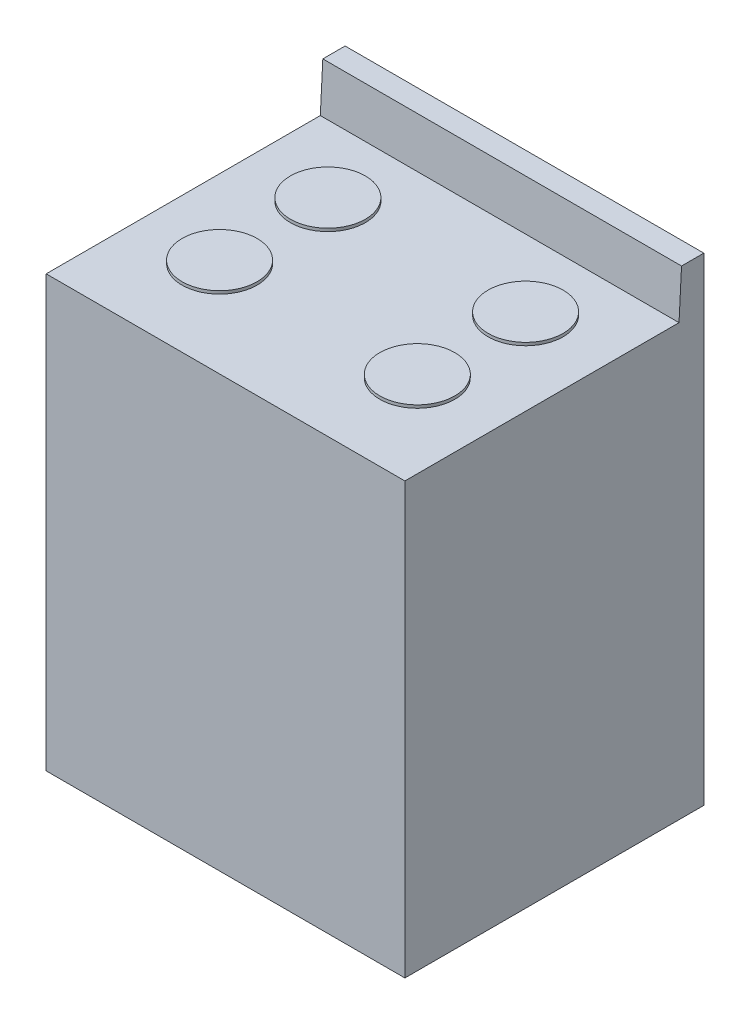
ISO-10303-21;
HEADER;
FILE_DESCRIPTION(('STEP AP214'),'2;1');
FILE_NAME('part.step','',(''),(''),'','','');
FILE_SCHEMA(('AUTOMOTIVE_DESIGN { 1 0 10303 214 1 1 1 1 }'));
ENDSEC;
DATA;
#1=APPLICATION_CONTEXT('core data for automotive mechanical design processes');
#2=APPLICATION_PROTOCOL_DEFINITION('international standard','automotive_design',2000,#1);
#3=PRODUCT_CONTEXT('',#1,'mechanical');
#4=PRODUCT('Part','Part','',(#3));
#5=PRODUCT_RELATED_PRODUCT_CATEGORY('part','',(#4));
#6=PRODUCT_DEFINITION_FORMATION('','',#4);
#7=PRODUCT_DEFINITION_CONTEXT('part definition',#1,'design');
#8=PRODUCT_DEFINITION('design','',#6,#7);
#9=PRODUCT_DEFINITION_SHAPE('','',#8);
#10=(LENGTH_UNIT() NAMED_UNIT(*) SI_UNIT(.MILLI.,.METRE.));
#11=(NAMED_UNIT(*) PLANE_ANGLE_UNIT() SI_UNIT($,.RADIAN.));
#12=(NAMED_UNIT(*) SI_UNIT($,.STERADIAN.) SOLID_ANGLE_UNIT());
#13=UNCERTAINTY_MEASURE_WITH_UNIT(LENGTH_MEASURE(1.E-05),#10,'distance_accuracy_value','');
#14=(GEOMETRIC_REPRESENTATION_CONTEXT(3) GLOBAL_UNCERTAINTY_ASSIGNED_CONTEXT((#13)) GLOBAL_UNIT_ASSIGNED_CONTEXT((#10,
#11,#12)) REPRESENTATION_CONTEXT('',''));
#15=CARTESIAN_POINT('',(0.,0.,0.));
#16=DIRECTION('',(0.,0.,1.));
#17=DIRECTION('',(1.,0.,0.));
#18=AXIS2_PLACEMENT_3D('',#15,#16,#17);
#19=CARTESIAN_POINT('',(-37.6058885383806,26.8823343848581,635.));
#20=DIRECTION('',(0.,-1.,0.));
#21=DIRECTION('',(0.,0.,-1.));
#22=AXIS2_PLACEMENT_3D('',#19,#20,#21);
#23=PLANE('',#22);
#24=CARTESIAN_POINT('',(127.659294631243,26.8823343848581,201.890902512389));
#25=DIRECTION('',(0.,-1.,0.));
#26=DIRECTION('',(0.,0.,-1.));
#27=AXIS2_PLACEMENT_3D('',#24,#25,#26);
#28=CIRCLE('',#27,79.6749402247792);
#29=CARTESIAN_POINT('',(127.659294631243,26.8823343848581,122.21596228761));
#30=VERTEX_POINT('',#29);
#31=EDGE_CURVE('E118',#30,#30,#28,.F.);
#32=ORIENTED_EDGE('',*,*,#31,.F.);
#33=EDGE_LOOP('',(#32));
#34=FACE_BOUND('',#33,.T.);
#35=DIRECTION('',(-1.,0.,0.));
#36=VECTOR('',#35,1.);
#37=CARTESIAN_POINT('',(-37.6058885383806,26.8823343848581,52.6913327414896));
#38=LINE('',#37,#36);
#39=CARTESIAN_POINT('',(-37.6058885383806,26.8823343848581,52.6913327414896));
#40=VERTEX_POINT('',#39);
#41=CARTESIAN_POINT('',(724.394111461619,26.8823343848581,52.6913327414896));
#42=VERTEX_POINT('',#41);
#43=EDGE_CURVE('E53',#40,#42,#38,.F.);
#44=ORIENTED_EDGE('',*,*,#43,.F.);
#45=DIRECTION('',(0.,0.,-1.));
#46=VECTOR('',#45,1.);
#47=CARTESIAN_POINT('',(-37.6058885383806,26.8823343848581,635.));
#48=LINE('',#47,#46);
#49=CARTESIAN_POINT('',(-37.6058885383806,26.8823343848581,635.));
#50=VERTEX_POINT('',#49);
#51=EDGE_CURVE('E98',#50,#40,#48,.T.);
#52=ORIENTED_EDGE('',*,*,#51,.F.);
#53=DIRECTION('',(-1.,0.,0.));
#54=VECTOR('',#53,1.);
#55=CARTESIAN_POINT('',(-37.6058885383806,26.8823343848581,635.));
#56=LINE('',#55,#54);
#57=CARTESIAN_POINT('',(724.394111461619,26.8823343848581,635.));
#58=VERTEX_POINT('',#57);
#59=EDGE_CURVE('E93',#58,#50,#56,.T.);
#60=ORIENTED_EDGE('',*,*,#59,.F.);
#61=DIRECTION('',(0.,0.,-1.));
#62=VECTOR('',#61,1.);
#63=CARTESIAN_POINT('',(724.394111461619,26.8823343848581,635.));
#64=LINE('',#63,#62);
#65=EDGE_CURVE('E91',#58,#42,#64,.T.);
#66=ORIENTED_EDGE('',*,*,#65,.T.);
#67=EDGE_LOOP('',(#44,#52,#60,#66));
#68=FACE_BOUND('',#67,.T.);
#69=CARTESIAN_POINT('',(547.659294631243,26.8823343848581,201.890902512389));
#70=DIRECTION('',(0.,-1.,0.));
#71=DIRECTION('',(0.,0.,-1.));
#72=AXIS2_PLACEMENT_3D('',#69,#70,#71);
#73=CIRCLE('',#72,79.6749402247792);
#74=CARTESIAN_POINT('',(547.659294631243,26.8823343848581,122.21596228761));
#75=VERTEX_POINT('',#74);
#76=EDGE_CURVE('E121',#75,#75,#73,.F.);
#77=ORIENTED_EDGE('',*,*,#76,.F.);
#78=EDGE_LOOP('',(#77));
#79=FACE_BOUND('',#78,.T.);
#80=CARTESIAN_POINT('',(127.659294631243,26.8823343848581,431.890902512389));
#81=DIRECTION('',(0.,-1.,0.));
#82=DIRECTION('',(0.,0.,-1.));
#83=AXIS2_PLACEMENT_3D('',#80,#81,#82);
#84=CIRCLE('',#83,79.6749402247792);
#85=CARTESIAN_POINT('',(127.659294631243,26.8823343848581,352.21596228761));
#86=VERTEX_POINT('',#85);
#87=EDGE_CURVE('E125',#86,#86,#84,.F.);
#88=ORIENTED_EDGE('',*,*,#87,.F.);
#89=EDGE_LOOP('',(#88));
#90=FACE_BOUND('',#89,.T.);
#91=CARTESIAN_POINT('',(547.659294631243,26.8823343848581,431.890902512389));
#92=DIRECTION('',(0.,-1.,0.));
#93=DIRECTION('',(0.,0.,-1.));
#94=AXIS2_PLACEMENT_3D('',#91,#92,#93);
#95=CIRCLE('',#94,79.6749402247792);
#96=CARTESIAN_POINT('',(547.659294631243,26.8823343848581,352.21596228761));
#97=VERTEX_POINT('',#96);
#98=EDGE_CURVE('E46',#97,#97,#95,.F.);
#99=ORIENTED_EDGE('',*,*,#98,.F.);
#100=EDGE_LOOP('',(#99));
#101=FACE_BOUND('',#100,.T.);
#102=ADVANCED_FACE('F37',(#34,#68,#79,#90,#101),#23,.F.);
#103=CARTESIAN_POINT('',(-37.6058885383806,26.8823343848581,635.));
#104=DIRECTION('',(1.,0.,0.));
#105=DIRECTION('',(0.,1.,0.));
#106=AXIS2_PLACEMENT_3D('',#103,#104,#105);
#107=PLANE('',#106);
#108=DIRECTION('',(0.,-1.,0.));
#109=VECTOR('',#108,1.);
#110=CARTESIAN_POINT('',(-37.6058885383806,26.8823343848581,0.));
#111=LINE('',#110,#109);
#112=CARTESIAN_POINT('',(-37.6058885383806,128.482334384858,0.));
#113=VERTEX_POINT('',#112);
#114=CARTESIAN_POINT('',(-37.6058885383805,-887.517665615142,0.));
#115=VERTEX_POINT('',#114);
#116=EDGE_CURVE('E113',#113,#115,#111,.T.);
#117=ORIENTED_EDGE('',*,*,#116,.T.);
#118=DIRECTION('',(0.,0.,-1.));
#119=VECTOR('',#118,1.);
#120=CARTESIAN_POINT('',(-37.6058885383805,-887.517665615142,635.));
#121=LINE('',#120,#119);
#122=CARTESIAN_POINT('',(-37.6058885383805,-887.517665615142,635.));
#123=VERTEX_POINT('',#122);
#124=EDGE_CURVE('E122',#123,#115,#121,.T.);
#125=ORIENTED_EDGE('',*,*,#124,.F.);
#126=DIRECTION('',(0.,-1.,0.));
#127=VECTOR('',#126,1.);
#128=CARTESIAN_POINT('',(-37.6058885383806,26.8823343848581,635.));
#129=LINE('',#128,#127);
#130=EDGE_CURVE('E313',#50,#123,#129,.T.);
#131=ORIENTED_EDGE('',*,*,#130,.F.);
#132=ORIENTED_EDGE('',*,*,#51,.T.);
#133=DIRECTION('',(0.,0.998629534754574,-0.052335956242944));
#134=VECTOR('',#133,1.);
#135=CARTESIAN_POINT('',(-37.6058885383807,128.482334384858,47.3667023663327));
#136=LINE('',#135,#134);
#137=CARTESIAN_POINT('',(-37.6058885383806,128.482334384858,47.3667023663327));
#138=VERTEX_POINT('',#137);
#139=EDGE_CURVE('E104',#138,#40,#136,.F.);
#140=ORIENTED_EDGE('',*,*,#139,.F.);
#141=DIRECTION('',(0.,0.,1.));
#142=VECTOR('',#141,1.);
#143=CARTESIAN_POINT('',(-37.6058885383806,128.482334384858,0.));
#144=LINE('',#143,#142);
#145=EDGE_CURVE('E105',#113,#138,#144,.T.);
#146=ORIENTED_EDGE('',*,*,#145,.F.);
#147=EDGE_LOOP('',(#117,#125,#131,#132,#140,#146));
#148=FACE_BOUND('',#147,.T.);
#149=ADVANCED_FACE('F136',(#148),#107,.F.);
#150=CARTESIAN_POINT('',(-37.6058885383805,-887.517665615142,635.));
#151=DIRECTION('',(0.,1.,0.));
#152=DIRECTION('',(0.,0.,1.));
#153=AXIS2_PLACEMENT_3D('',#150,#151,#152);
#154=PLANE('',#153);
#155=DIRECTION('',(1.,0.,0.));
#156=VECTOR('',#155,1.);
#157=CARTESIAN_POINT('',(-37.6058885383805,-887.517665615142,0.));
#158=LINE('',#157,#156);
#159=CARTESIAN_POINT('',(724.394111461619,-887.517665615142,0.));
#160=VERTEX_POINT('',#159);
#161=EDGE_CURVE('E328',#115,#160,#158,.T.);
#162=ORIENTED_EDGE('',*,*,#161,.T.);
#163=DIRECTION('',(0.,0.,-1.));
#164=VECTOR('',#163,1.);
#165=CARTESIAN_POINT('',(724.394111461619,-887.517665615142,635.));
#166=LINE('',#165,#164);
#167=CARTESIAN_POINT('',(724.394111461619,-887.517665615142,635.));
#168=VERTEX_POINT('',#167);
#169=EDGE_CURVE('E97',#168,#160,#166,.T.);
#170=ORIENTED_EDGE('',*,*,#169,.F.);
#171=DIRECTION('',(1.,0.,0.));
#172=VECTOR('',#171,1.);
#173=CARTESIAN_POINT('',(-37.6058885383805,-887.517665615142,635.));
#174=LINE('',#173,#172);
#175=EDGE_CURVE('E315',#123,#168,#174,.T.);
#176=ORIENTED_EDGE('',*,*,#175,.F.);
#177=ORIENTED_EDGE('',*,*,#124,.T.);
#178=EDGE_LOOP('',(#162,#170,#176,#177));
#179=FACE_BOUND('',#178,.T.);
#180=ADVANCED_FACE('F142',(#179),#154,.F.);
#181=CARTESIAN_POINT('',(724.394111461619,26.8823343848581,635.));
#182=DIRECTION('',(-1.,0.,0.));
#183=DIRECTION('',(0.,-1.,0.));
#184=AXIS2_PLACEMENT_3D('',#181,#182,#183);
#185=PLANE('',#184);
#186=DIRECTION('',(0.,1.,0.));
#187=VECTOR('',#186,1.);
#188=CARTESIAN_POINT('',(724.394111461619,26.8823343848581,0.));
#189=LINE('',#188,#187);
#190=CARTESIAN_POINT('',(724.394111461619,128.482334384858,0.));
#191=VERTEX_POINT('',#190);
#192=EDGE_CURVE('E317',#160,#191,#189,.T.);
#193=ORIENTED_EDGE('',*,*,#192,.T.);
#194=DIRECTION('',(0.,0.,-1.));
#195=VECTOR('',#194,1.);
#196=CARTESIAN_POINT('',(724.394111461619,128.482334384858,0.));
#197=LINE('',#196,#195);
#198=CARTESIAN_POINT('',(724.394111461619,128.482334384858,47.3667023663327));
#199=VERTEX_POINT('',#198);
#200=EDGE_CURVE('E110',#199,#191,#197,.T.);
#201=ORIENTED_EDGE('',*,*,#200,.F.);
#202=DIRECTION('',(0.,0.998629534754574,-0.052335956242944));
#203=VECTOR('',#202,1.);
#204=CARTESIAN_POINT('',(724.394111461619,-3.55158068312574,54.2863066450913));
#205=LINE('',#204,#203);
#206=EDGE_CURVE('E101',#199,#42,#205,.F.);
#207=ORIENTED_EDGE('',*,*,#206,.T.);
#208=ORIENTED_EDGE('',*,*,#65,.F.);
#209=DIRECTION('',(0.,1.,0.));
#210=VECTOR('',#209,1.);
#211=CARTESIAN_POINT('',(724.394111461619,26.8823343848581,635.));
#212=LINE('',#211,#210);
#213=EDGE_CURVE('E332',#168,#58,#212,.T.);
#214=ORIENTED_EDGE('',*,*,#213,.F.);
#215=ORIENTED_EDGE('',*,*,#169,.T.);
#216=EDGE_LOOP('',(#193,#201,#207,#208,#214,#215));
#217=FACE_BOUND('',#216,.T.);
#218=ADVANCED_FACE('F108',(#217),#185,.F.);
#219=CARTESIAN_POINT('',(-37.6058885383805,-887.517665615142,635.));
#220=DIRECTION('',(0.,0.,1.));
#221=DIRECTION('',(1.,0.,0.));
#222=AXIS2_PLACEMENT_3D('',#219,#220,#221);
#223=PLANE('',#222);
#224=ORIENTED_EDGE('',*,*,#130,.T.);
#225=ORIENTED_EDGE('',*,*,#175,.T.);
#226=ORIENTED_EDGE('',*,*,#213,.T.);
#227=ORIENTED_EDGE('',*,*,#59,.T.);
#228=EDGE_LOOP('',(#224,#225,#226,#227));
#229=FACE_BOUND('',#228,.T.);
#230=ADVANCED_FACE('F152',(#229),#223,.T.);
#231=CARTESIAN_POINT('',(-37.6058885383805,-887.517665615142,0.));
#232=DIRECTION('',(0.,0.,1.));
#233=DIRECTION('',(1.,0.,0.));
#234=AXIS2_PLACEMENT_3D('',#231,#232,#233);
#235=PLANE('',#234);
#236=ORIENTED_EDGE('',*,*,#116,.F.);
#237=DIRECTION('',(-1.,0.,0.));
#238=VECTOR('',#237,1.);
#239=CARTESIAN_POINT('',(-37.6058885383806,128.482334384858,0.));
#240=LINE('',#239,#238);
#241=EDGE_CURVE('E111',#191,#113,#240,.T.);
#242=ORIENTED_EDGE('',*,*,#241,.F.);
#243=ORIENTED_EDGE('',*,*,#192,.F.);
#244=ORIENTED_EDGE('',*,*,#161,.F.);
#245=EDGE_LOOP('',(#236,#242,#243,#244));
#246=FACE_BOUND('',#245,.T.);
#247=ADVANCED_FACE('F148',(#246),#235,.F.);
#248=CARTESIAN_POINT('',(-37.6058885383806,128.482334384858,47.3667023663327));
#249=DIRECTION('',(0.,0.0523359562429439,0.998629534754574));
#250=DIRECTION('',(0.,-0.998629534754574,0.052335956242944));
#251=AXIS2_PLACEMENT_3D('',#248,#249,#250);
#252=PLANE('',#251);
#253=ORIENTED_EDGE('',*,*,#43,.T.);
#254=ORIENTED_EDGE('',*,*,#206,.F.);
#255=DIRECTION('',(1.,0.,0.));
#256=VECTOR('',#255,1.);
#257=CARTESIAN_POINT('',(-37.6058885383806,128.482334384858,47.3667023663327));
#258=LINE('',#257,#256);
#259=EDGE_CURVE('E87',#138,#199,#258,.T.);
#260=ORIENTED_EDGE('',*,*,#259,.F.);
#261=ORIENTED_EDGE('',*,*,#139,.T.);
#262=EDGE_LOOP('',(#253,#254,#260,#261));
#263=FACE_BOUND('',#262,.T.);
#264=ADVANCED_FACE('F100',(#263),#252,.T.);
#265=CARTESIAN_POINT('',(-37.6058885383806,128.482334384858,47.3667023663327));
#266=DIRECTION('',(0.,1.,0.));
#267=DIRECTION('',(0.,0.,1.));
#268=AXIS2_PLACEMENT_3D('',#265,#266,#267);
#269=PLANE('',#268);
#270=ORIENTED_EDGE('',*,*,#145,.T.);
#271=ORIENTED_EDGE('',*,*,#259,.T.);
#272=ORIENTED_EDGE('',*,*,#200,.T.);
#273=ORIENTED_EDGE('',*,*,#241,.T.);
#274=EDGE_LOOP('',(#270,#271,#272,#273));
#275=FACE_BOUND('',#274,.T.);
#276=ADVANCED_FACE('F158',(#275),#269,.T.);
#277=CARTESIAN_POINT('',(127.659294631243,33.2323343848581,201.890902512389));
#278=DIRECTION('',(0.,-1.,0.));
#279=DIRECTION('',(0.,0.,-1.));
#280=AXIS2_PLACEMENT_3D('',#277,#278,#279);
#281=CYLINDRICAL_SURFACE('',#280,79.6749402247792);
#282=CARTESIAN_POINT('',(127.659294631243,33.2323343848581,201.890902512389));
#283=DIRECTION('',(0.,1.,0.));
#284=DIRECTION('',(0.,0.,1.));
#285=AXIS2_PLACEMENT_3D('',#282,#283,#284);
#286=CIRCLE('',#285,79.6749402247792);
#287=CARTESIAN_POINT('',(127.659294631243,33.2323343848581,281.565842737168));
#288=VERTEX_POINT('',#287);
#289=EDGE_CURVE('E106',#288,#288,#286,.T.);
#290=ORIENTED_EDGE('',*,*,#289,.F.);
#291=EDGE_LOOP('',(#290));
#292=FACE_BOUND('',#291,.T.);
#293=ORIENTED_EDGE('',*,*,#31,.T.);
#294=EDGE_LOOP('',(#293));
#295=FACE_BOUND('',#294,.T.);
#296=ADVANCED_FACE('F206',(#292,#295),#281,.T.);
#297=CARTESIAN_POINT('',(127.659294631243,33.2323343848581,201.890902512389));
#298=DIRECTION('',(0.,1.,0.));
#299=DIRECTION('',(0.,0.,1.));
#300=AXIS2_PLACEMENT_3D('',#297,#298,#299);
#301=PLANE('',#300);
#302=ORIENTED_EDGE('',*,*,#289,.T.);
#303=EDGE_LOOP('',(#302));
#304=FACE_BOUND('',#303,.T.);
#305=ADVANCED_FACE('F194',(#304),#301,.T.);
#306=CARTESIAN_POINT('',(547.659294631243,33.2323343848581,201.890902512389));
#307=DIRECTION('',(0.,-1.,0.));
#308=DIRECTION('',(0.,0.,-1.));
#309=AXIS2_PLACEMENT_3D('',#306,#307,#308);
#310=CYLINDRICAL_SURFACE('',#309,79.6749402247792);
#311=CARTESIAN_POINT('',(547.659294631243,33.2323343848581,201.890902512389));
#312=DIRECTION('',(0.,1.,0.));
#313=DIRECTION('',(0.,0.,1.));
#314=AXIS2_PLACEMENT_3D('',#311,#312,#313);
#315=CIRCLE('',#314,79.6749402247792);
#316=CARTESIAN_POINT('',(547.659294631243,33.2323343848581,281.565842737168));
#317=VERTEX_POINT('',#316);
#318=EDGE_CURVE('E340',#317,#317,#315,.T.);
#319=ORIENTED_EDGE('',*,*,#318,.F.);
#320=EDGE_LOOP('',(#319));
#321=FACE_BOUND('',#320,.T.);
#322=ORIENTED_EDGE('',*,*,#76,.T.);
#323=EDGE_LOOP('',(#322));
#324=FACE_BOUND('',#323,.T.);
#325=ADVANCED_FACE('F167',(#321,#324),#310,.T.);
#326=CARTESIAN_POINT('',(547.659294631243,33.2323343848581,201.890902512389));
#327=DIRECTION('',(0.,1.,0.));
#328=DIRECTION('',(0.,0.,1.));
#329=AXIS2_PLACEMENT_3D('',#326,#327,#328);
#330=PLANE('',#329);
#331=ORIENTED_EDGE('',*,*,#318,.T.);
#332=EDGE_LOOP('',(#331));
#333=FACE_BOUND('',#332,.T.);
#334=ADVANCED_FACE('F165',(#333),#330,.T.);
#335=CARTESIAN_POINT('',(127.659294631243,33.2323343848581,431.890902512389));
#336=DIRECTION('',(0.,1.,0.));
#337=DIRECTION('',(0.,0.,1.));
#338=AXIS2_PLACEMENT_3D('',#335,#336,#337);
#339=PLANE('',#338);
#340=CARTESIAN_POINT('',(127.659294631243,33.2323343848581,431.890902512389));
#341=DIRECTION('',(0.,1.,0.));
#342=DIRECTION('',(0.,0.,1.));
#343=AXIS2_PLACEMENT_3D('',#340,#341,#342);
#344=CIRCLE('',#343,79.6749402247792);
#345=CARTESIAN_POINT('',(127.659294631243,33.2323343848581,511.565842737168));
#346=VERTEX_POINT('',#345);
#347=EDGE_CURVE('E128',#346,#346,#344,.T.);
#348=ORIENTED_EDGE('',*,*,#347,.T.);
#349=EDGE_LOOP('',(#348));
#350=FACE_BOUND('',#349,.T.);
#351=ADVANCED_FACE('F162',(#350),#339,.T.);
#352=CARTESIAN_POINT('',(127.659294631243,33.2323343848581,431.890902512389));
#353=DIRECTION('',(0.,-1.,0.));
#354=DIRECTION('',(0.,0.,-1.));
#355=AXIS2_PLACEMENT_3D('',#352,#353,#354);
#356=CYLINDRICAL_SURFACE('',#355,79.6749402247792);
#357=ORIENTED_EDGE('',*,*,#347,.F.);
#358=EDGE_LOOP('',(#357));
#359=FACE_BOUND('',#358,.T.);
#360=ORIENTED_EDGE('',*,*,#87,.T.);
#361=EDGE_LOOP('',(#360));
#362=FACE_BOUND('',#361,.T.);
#363=ADVANCED_FACE('F159',(#359,#362),#356,.T.);
#364=CARTESIAN_POINT('',(547.659294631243,33.2323343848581,431.890902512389));
#365=DIRECTION('',(0.,1.,0.));
#366=DIRECTION('',(0.,0.,1.));
#367=AXIS2_PLACEMENT_3D('',#364,#365,#366);
#368=PLANE('',#367);
#369=CARTESIAN_POINT('',(547.659294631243,33.2323343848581,431.890902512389));
#370=DIRECTION('',(0.,1.,0.));
#371=DIRECTION('',(0.,0.,1.));
#372=AXIS2_PLACEMENT_3D('',#369,#370,#371);
#373=CIRCLE('',#372,79.6749402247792);
#374=CARTESIAN_POINT('',(547.659294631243,33.2323343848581,511.565842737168));
#375=VERTEX_POINT('',#374);
#376=EDGE_CURVE('E11',#375,#375,#373,.T.);
#377=ORIENTED_EDGE('',*,*,#376,.T.);
#378=EDGE_LOOP('',(#377));
#379=FACE_BOUND('',#378,.T.);
#380=ADVANCED_FACE('F39',(#379),#368,.T.);
#381=CARTESIAN_POINT('',(547.659294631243,33.2323343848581,431.890902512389));
#382=DIRECTION('',(0.,-1.,0.));
#383=DIRECTION('',(0.,0.,-1.));
#384=AXIS2_PLACEMENT_3D('',#381,#382,#383);
#385=CYLINDRICAL_SURFACE('',#384,79.6749402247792);
#386=ORIENTED_EDGE('',*,*,#376,.F.);
#387=EDGE_LOOP('',(#386));
#388=FACE_BOUND('',#387,.T.);
#389=ORIENTED_EDGE('',*,*,#98,.T.);
#390=EDGE_LOOP('',(#389));
#391=FACE_BOUND('',#390,.T.);
#392=ADVANCED_FACE('F133',(#388,#391),#385,.T.);
#393=CLOSED_SHELL('',(#102,#149,#180,#218,#230,#247,#264,#276,#296,#305,#325,#334,#351,#363,
#380,#392));
#394=MANIFOLD_SOLID_BREP('B2',#393);
#395=ADVANCED_BREP_SHAPE_REPRESENTATION('',(#18,#394),#14);
#396=SHAPE_DEFINITION_REPRESENTATION(#9,#395);
ENDSEC;
END-ISO-10303-21;
